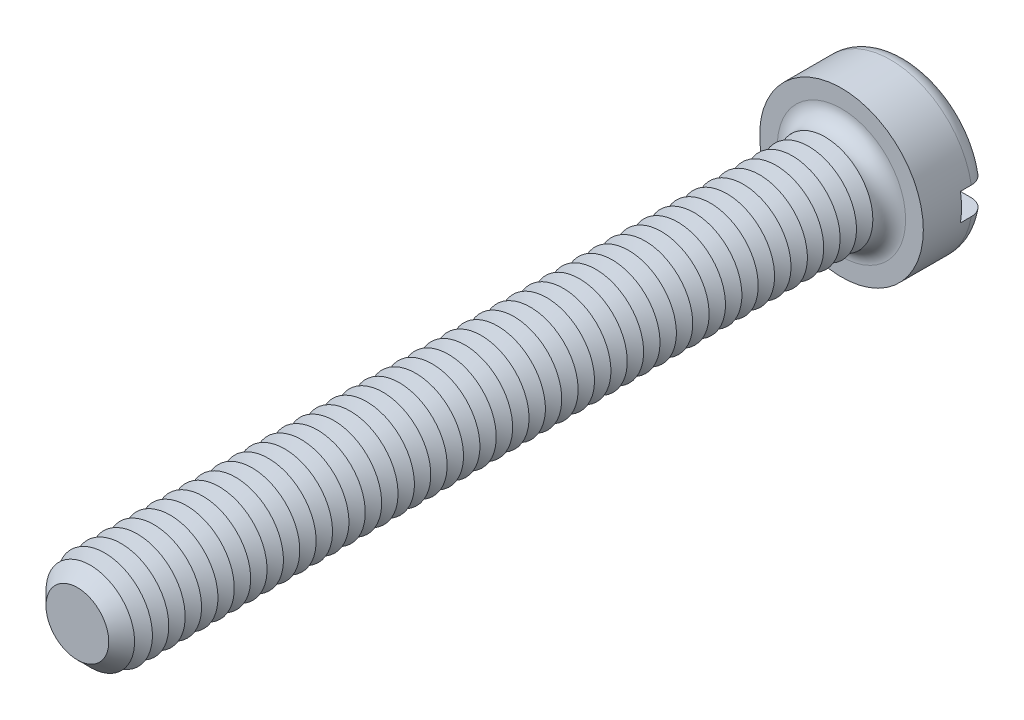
from build123d import *

# Parameters (mm, degrees)
SKETCH3_R           = 3
BOSS_EXTRUDE2_DEPTH = 2.4
SKETCH4_R           = 1.75
BOSS_EXTRUDE3_DEPTH = 28
FILLET1_R           = 0.6
CHAMFER1_SIZE       = 0.6
LPATTERN1_COUNT     = 45
LPATTERN1_PITCH     = 0.6
SKETCH8_W           = 6
SKETCH8_H           = 1
CUT_EXTRUDE1_DEPTH  = 1


with BuildPart() as part:
    # Sketch3 → Boss-Extrude2 (new body)
    with BuildSketch(Plane.XY):
        Circle(SKETCH3_R)
    extrude(amount=-BOSS_EXTRUDE2_DEPTH)

    # Sketch4 → Boss-Extrude3 (add)
    with BuildSketch(Plane.XY):
        Circle(SKETCH4_R)
    extrude(amount=BOSS_EXTRUDE3_DEPTH)

    # Fillet1
    fillet1_edges = [part.edges().sort_by_distance(p)[0] for p in [
        (-3, 0, -2.4),
        (-1.75, 0, 0),
    ]]
    fillet(fillet1_edges, radius=FILLET1_R)

    # Chamfer1
    chamfer1_edges = [part.edges().sort_by_distance(p)[0] for p in [
        (-1.75, 0, 28),
    ]]
    chamfer(chamfer1_edges, length=CHAMFER1_SIZE)

    # Sketch6 → Cut-Revolve1 (revolve, cut)
    with BuildSketch(Plane(origin=(0, 0, 0), x_dir=(0, 0, -1), z_dir=(1, 0, 0)), mode=Mode.PRIVATE) as cut_revolve1_sk:
        Polygon((-0.6, 1.75), (-0.9, 1.230384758), (-1.2, 1.75), align=None)
    cut_revolve1 = revolve(cut_revolve1_sk.sketch.rotate(Axis((0, 0, -1.694361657), (0, 0, 1)), 90), axis=Axis((0, 0, -1.694361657), (0, 0, 1)), mode=Mode.SUBTRACT)

    # LPattern1: Cut-Revolve1 ×45
    with Locations(*[(0, 0, i * LPATTERN1_PITCH) for i in range(1, LPATTERN1_COUNT)]):
        add(cut_revolve1, mode=Mode.SUBTRACT)

    # Sketch8 → Cut-Extrude1 (cut)
    with BuildSketch(Plane(origin=(0, 0, -2.4), x_dir=(-1, 0, 0), z_dir=(0, 0, -1))):
        Rectangle(SKETCH8_W, SKETCH8_H)
    extrude(amount=-CUT_EXTRUDE1_DEPTH, mode=Mode.SUBTRACT)


solid = part.part
